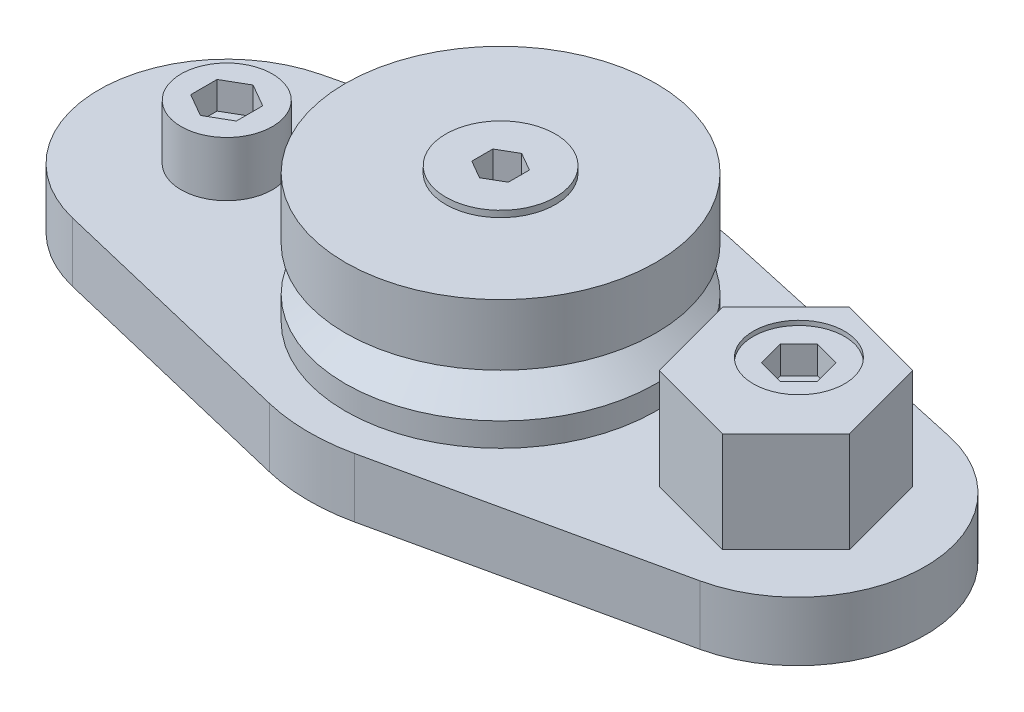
from build123d import *

# Parameters (mm, degrees)
SKIZZE1_R                       = 3.3
AUFSATZ_LINEAR_AUSTRAGEN1_DEPTH = 6.5
SCHNITT_LINEAR_AUSTRAGEN1_DEPTH = 3
SCHNITT_LINEAR_AUSTRAGEN2_DEPTH = 3
AUFSATZ_LINEAR_AUSTRAGEN2_DEPTH = 11
SCHNITT_LINEAR_AUSTRAGEN3_DEPTH = 3.5
SKIZZE8_W                       = 5
SKIZZE8_H                       = 0.5
SKIZZE9_W                       = 6.305
SKIZZE9_H                       = 6.5


with BuildPart() as part:
    # Skizze1 → Aufsatz-Linear austragen1 (new body)
    with BuildSketch(Plane(origin=(0, 0, 0), x_dir=(1, 0, 0), z_dir=(0, 1, 0))):
        with BuildLine():
            Line((-33.266666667, -13.613555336), (-4.9, -20.420333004))
            ThreePointArc((-4.9, -20.420333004), (-0.193392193, -20.999109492), (4.523076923, -20.507115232))
            Line((4.523076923, -20.507115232), (35.515384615, -13.671410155))
            ThreePointArc((35.515384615, -13.671410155), (46.5, 0), (35.515384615, 13.671410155))
            Line((35.515384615, 13.671410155), (4.523076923, 20.507115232))
            ThreePointArc((4.523076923, 20.507115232), (-0.193392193, 20.999109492), (-4.9, 20.420333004))
            Line((-4.9, 20.420333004), (-33.266666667, 13.613555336))
            ThreePointArc((-33.266666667, 13.613555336), (-44, 0), (-33.266666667, -13.613555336))
        make_face()
        with Locations(Location((-30, 0, 0), (0, 0, 90))):
            Circle(SKIZZE1_R, mode=Mode.SUBTRACT)
        with BuildLine():
            Line((27.5, -6.325), (32.5, -6.325))
            ThreePointArc((32.5, -6.325), (38.825, 0), (32.5, 6.325))
            Line((32.5, 6.325), (27.5, 6.325))
            ThreePointArc((27.5, 6.325), (21.175, 0), (27.5, -6.325))
        make_face(mode=Mode.SUBTRACT)
    extrude(amount=AUFSATZ_LINEAR_AUSTRAGEN1_DEPTH)

    # Skizze2 → Rotation1 (revolve)
    with BuildSketch(Plane.XY, mode=Mode.PRIVATE) as rotation1_sk:
        Polygon((0, 21.3), (6, 21.3), (6, 20.6), (17, 20.6), (17, 13.905212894), (13.565, 11.5), (17, 9.094787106), (17, 0), (0, 0), align=None)
    revolve(rotation1_sk.sketch.rotate(Axis((0, 0, 0), (0, 1, 0)), 270), axis=Axis((0, 0, 0), (0, 1, 0)))

    # Skizze3 → Schnitt-Linear austragen1 (cut)
    with BuildSketch(Plane(origin=(0, 21.3, 0), x_dir=(1, 0, 0), z_dir=(0, 1, 0))):
        Polygon((-2, -1.154700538), (0, -2.309401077), (2, -1.154700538), (2, 1.154700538), (0, 2.309401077), (-2, 1.154700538), align=None)
    extrude(amount=-SCHNITT_LINEAR_AUSTRAGEN1_DEPTH, mode=Mode.SUBTRACT)

    # Skizze4 → Rotation2 (revolve)
    with BuildSketch(Plane.XY, mode=Mode.PRIVATE) as rotation2_sk:
        Polygon((-30, 12.5), (-25, 12.5), (-25, 6.5), (-27, 6.5), (-27, -8.8865), (-27.6135, -9.5), (-30, -9.5), align=None)
    revolve(rotation2_sk.sketch.rotate(Axis((-30, -9.5, 0), (0, 1, 0)), 270), axis=Axis((-30, -9.5, 0), (0, 1, 0)))

    # Skizze5 → Schnitt-Linear austragen2 (cut)
    with BuildSketch(Plane(origin=(0, 12.5, 0), x_dir=(1, 0, 0), z_dir=(0, 1, 0))):
        Polygon((-32.5, -1.443375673), (-30, -2.886751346), (-27.5, -1.443375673), (-27.5, 1.443375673), (-30, 2.886751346), (-32.5, 1.443375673), align=None)
    extrude(amount=-SCHNITT_LINEAR_AUSTRAGEN2_DEPTH, mode=Mode.SUBTRACT)

    # Skizze6 → Aufsatz-Linear austragen2 (add)
    with BuildSketch(Plane(origin=(0, 17.5, 0), x_dir=(1, 0, 0), z_dir=(0, 1, 0))):
        Polygon((21.779481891, 2.540297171), (24.319779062, -6.940220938), (33.800297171, -9.480518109), (40.740518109, -2.540297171), (38.200220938, 6.940220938), (28.719702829, 9.480518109), align=None)
    extrude(amount=-AUFSATZ_LINEAR_AUSTRAGEN2_DEPTH)

    # Skizze7 → Schnitt-Linear austragen3 (cut)
    with BuildSketch(Plane(origin=(0, 17.5, 0), x_dir=(1, 0, 0), z_dir=(0, 1, 0))):
        Polygon((27.953974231, 2.678997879), (28.701120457, -0.1093898), (31.489508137, -0.856536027), (33.530749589, 1.184705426), (32.783603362, 3.973093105), (29.995215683, 4.720239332), align=None)
    extrude(amount=-SCHNITT_LINEAR_AUSTRAGEN3_DEPTH, mode=Mode.SUBTRACT)

    # Skizze8 → Schnitt-Rotation1 (revolve, cut)
    with BuildSketch(Plane(origin=(29.165977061, 0, -7.815), x_dir=(-0.2588190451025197, 0, -0.9659258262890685), z_dir=(0.9659258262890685, 0, -0.2588190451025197)), mode=Mode.PRIVATE) as schnitt_rotation1_sk:
        with Locations((-3.59068335, 17.25)):
            Rectangle(SKIZZE8_W, SKIZZE8_H)
    revolve(schnitt_rotation1_sk.sketch.rotate(Axis((30.74236191, 17, -1.931851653), (0, 1, 0)), 165), axis=Axis((30.74236191, 17, -1.931851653), (0, 1, 0)), mode=Mode.SUBTRACT)

    # Skizze9 → Rotation3 (revolve)
    with BuildSketch(Plane.XY, mode=Mode.PRIVATE) as rotation3_sk:
        with Locations((34.4125, 3.25)):
            Rectangle(SKIZZE9_W, SKIZZE9_H)
    revolve(rotation3_sk.sketch.rotate(Axis((31.26, 0, 0), (0, 1, 0)), 270), axis=Axis((31.26, 0, 0), (0, 1, 0)))

    # Skizze10 → Rotation4 (revolve)
    with BuildSketch(Plane(origin=(29.165977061, 0, -7.815), x_dir=(-0.2588190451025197, 0, -0.9659258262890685), z_dir=(0.9659258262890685, 0, -0.2588190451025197)), mode=Mode.PRIVATE) as rotation4_sk:
        Polygon((-6.09068335, 6.5), (-3.09068335, 6.5), (-3.09068335, -7.8865), (-3.70418335, -8.5), (-6.09068335, -8.5), align=None)
    revolve(rotation4_sk.sketch.rotate(Axis((30.74236191, -8.5, -1.931851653), (0, 1, 0)), 165), axis=Axis((30.74236191, -8.5, -1.931851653), (0, 1, 0)))


solid = part.part
